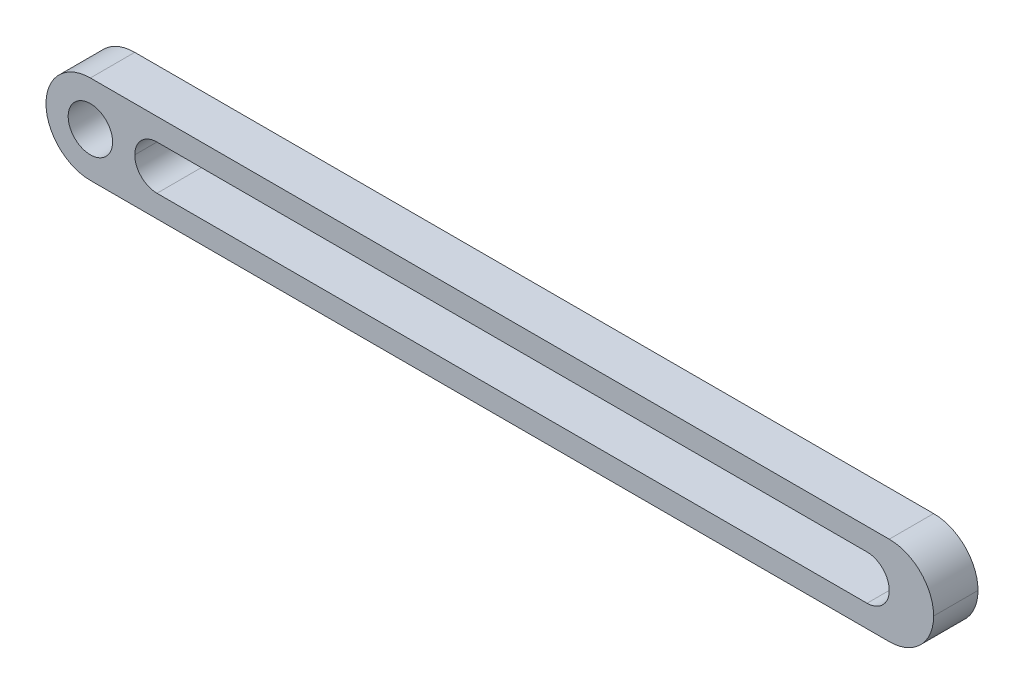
ISO-10303-21;
HEADER;
FILE_DESCRIPTION(('STEP AP214'),'2;1');
FILE_NAME('part.step','',(''),(''),'','','');
FILE_SCHEMA(('AUTOMOTIVE_DESIGN { 1 0 10303 214 1 1 1 1 }'));
ENDSEC;
DATA;
#1=APPLICATION_CONTEXT('core data for automotive mechanical design processes');
#2=APPLICATION_PROTOCOL_DEFINITION('international standard','automotive_design',2000,#1);
#3=PRODUCT_CONTEXT('',#1,'mechanical');
#4=PRODUCT('Part','Part','',(#3));
#5=PRODUCT_RELATED_PRODUCT_CATEGORY('part','',(#4));
#6=PRODUCT_DEFINITION_FORMATION('','',#4);
#7=PRODUCT_DEFINITION_CONTEXT('part definition',#1,'design');
#8=PRODUCT_DEFINITION('design','',#6,#7);
#9=PRODUCT_DEFINITION_SHAPE('','',#8);
#10=(LENGTH_UNIT() NAMED_UNIT(*) SI_UNIT(.MILLI.,.METRE.));
#11=(NAMED_UNIT(*) PLANE_ANGLE_UNIT() SI_UNIT($,.RADIAN.));
#12=(NAMED_UNIT(*) SI_UNIT($,.STERADIAN.) SOLID_ANGLE_UNIT());
#13=UNCERTAINTY_MEASURE_WITH_UNIT(LENGTH_MEASURE(1.E-05),#10,'distance_accuracy_value','');
#14=(GEOMETRIC_REPRESENTATION_CONTEXT(3) GLOBAL_UNCERTAINTY_ASSIGNED_CONTEXT((#13)) GLOBAL_UNIT_ASSIGNED_CONTEXT((#10,
#11,#12)) REPRESENTATION_CONTEXT('',''));
#15=CARTESIAN_POINT('',(0.,0.,0.));
#16=DIRECTION('',(0.,0.,1.));
#17=DIRECTION('',(1.,0.,0.));
#18=AXIS2_PLACEMENT_3D('',#15,#16,#17);
#19=CARTESIAN_POINT('',(0.,0.,10.));
#20=DIRECTION('',(0.,1.,0.));
#21=DIRECTION('',(0.,0.,1.));
#22=AXIS2_PLACEMENT_3D('',#19,#20,#21);
#23=PLANE('',#22);
#24=DIRECTION('',(1.,0.,0.));
#25=VECTOR('',#24,1.);
#26=CARTESIAN_POINT('',(0.,0.,0.));
#27=LINE('',#26,#25);
#28=CARTESIAN_POINT('',(10.,0.,0.));
#29=VERTEX_POINT('',#28);
#30=CARTESIAN_POINT('',(190.,0.,0.));
#31=VERTEX_POINT('',#30);
#32=EDGE_CURVE('E129',#29,#31,#27,.T.);
#33=ORIENTED_EDGE('',*,*,#32,.T.);
#34=DIRECTION('',(0.,0.,-1.));
#35=VECTOR('',#34,1.);
#36=CARTESIAN_POINT('',(190.,0.,10.));
#37=LINE('',#36,#35);
#38=CARTESIAN_POINT('',(190.,0.,10.));
#39=VERTEX_POINT('',#38);
#40=EDGE_CURVE('E226',#31,#39,#37,.F.);
#41=ORIENTED_EDGE('',*,*,#40,.T.);
#42=DIRECTION('',(1.,0.,0.));
#43=VECTOR('',#42,1.);
#44=CARTESIAN_POINT('',(0.,0.,10.));
#45=LINE('',#44,#43);
#46=CARTESIAN_POINT('',(10.,0.,10.));
#47=VERTEX_POINT('',#46);
#48=EDGE_CURVE('E213',#47,#39,#45,.T.);
#49=ORIENTED_EDGE('',*,*,#48,.F.);
#50=DIRECTION('',(0.,0.,-1.));
#51=VECTOR('',#50,1.);
#52=CARTESIAN_POINT('',(10.,0.,10.));
#53=LINE('',#52,#51);
#54=EDGE_CURVE('E224',#47,#29,#53,.T.);
#55=ORIENTED_EDGE('',*,*,#54,.T.);
#56=EDGE_LOOP('',(#33,#41,#49,#55));
#57=FACE_BOUND('',#56,.T.);
#58=ADVANCED_FACE('F33',(#57),#23,.F.);
#59=CARTESIAN_POINT('',(0.,20.,10.));
#60=DIRECTION('',(0.,-1.,0.));
#61=DIRECTION('',(0.,0.,-1.));
#62=AXIS2_PLACEMENT_3D('',#59,#60,#61);
#63=PLANE('',#62);
#64=DIRECTION('',(-1.,0.,0.));
#65=VECTOR('',#64,1.);
#66=CARTESIAN_POINT('',(0.,20.,10.));
#67=LINE('',#66,#65);
#68=CARTESIAN_POINT('',(190.,20.,10.));
#69=VERTEX_POINT('',#68);
#70=CARTESIAN_POINT('',(10.,20.,10.));
#71=VERTEX_POINT('',#70);
#72=EDGE_CURVE('E144',#69,#71,#67,.T.);
#73=ORIENTED_EDGE('',*,*,#72,.F.);
#74=DIRECTION('',(0.,0.,-1.));
#75=VECTOR('',#74,1.);
#76=CARTESIAN_POINT('',(190.,20.,10.));
#77=LINE('',#76,#75);
#78=CARTESIAN_POINT('',(190.,20.,0.));
#79=VERTEX_POINT('',#78);
#80=EDGE_CURVE('E161',#69,#79,#77,.T.);
#81=ORIENTED_EDGE('',*,*,#80,.T.);
#82=DIRECTION('',(-1.,0.,0.));
#83=VECTOR('',#82,1.);
#84=CARTESIAN_POINT('',(0.,20.,0.));
#85=LINE('',#84,#83);
#86=CARTESIAN_POINT('',(10.,20.,0.));
#87=VERTEX_POINT('',#86);
#88=EDGE_CURVE('E216',#79,#87,#85,.T.);
#89=ORIENTED_EDGE('',*,*,#88,.T.);
#90=DIRECTION('',(0.,0.,-1.));
#91=VECTOR('',#90,1.);
#92=CARTESIAN_POINT('',(10.,20.,10.));
#93=LINE('',#92,#91);
#94=EDGE_CURVE('E143',#87,#71,#93,.F.);
#95=ORIENTED_EDGE('',*,*,#94,.T.);
#96=EDGE_LOOP('',(#73,#81,#89,#95));
#97=FACE_BOUND('',#96,.T.);
#98=ADVANCED_FACE('F239',(#97),#63,.F.);
#99=CARTESIAN_POINT('',(0.,0.,10.));
#100=DIRECTION('',(0.,0.,-1.));
#101=DIRECTION('',(-1.,0.,0.));
#102=AXIS2_PLACEMENT_3D('',#99,#100,#101);
#103=PLANE('',#102);
#104=CARTESIAN_POINT('',(25.,10.,10.));
#105=DIRECTION('',(0.,0.,-1.));
#106=DIRECTION('',(-1.,0.,0.));
#107=AXIS2_PLACEMENT_3D('',#104,#105,#106);
#108=CIRCLE('',#107,5.);
#109=CARTESIAN_POINT('',(25.,5.,10.));
#110=VERTEX_POINT('',#109);
#111=CARTESIAN_POINT('',(20.,10.,10.));
#112=VERTEX_POINT('',#111);
#113=EDGE_CURVE('E56',#110,#112,#108,.T.);
#114=ORIENTED_EDGE('',*,*,#113,.T.);
#115=CARTESIAN_POINT('',(25.,10.,10.));
#116=DIRECTION('',(0.,0.,-1.));
#117=DIRECTION('',(-1.,0.,0.));
#118=AXIS2_PLACEMENT_3D('',#115,#116,#117);
#119=CIRCLE('',#118,5.);
#120=CARTESIAN_POINT('',(25.,15.,10.));
#121=VERTEX_POINT('',#120);
#122=EDGE_CURVE('E42',#112,#121,#119,.T.);
#123=ORIENTED_EDGE('',*,*,#122,.T.);
#124=DIRECTION('',(-1.,0.,0.));
#125=VECTOR('',#124,1.);
#126=CARTESIAN_POINT('',(20.,15.,10.));
#127=LINE('',#126,#125);
#128=CARTESIAN_POINT('',(185.,15.,10.));
#129=VERTEX_POINT('',#128);
#130=EDGE_CURVE('E187',#129,#121,#127,.T.);
#131=ORIENTED_EDGE('',*,*,#130,.F.);
#132=CARTESIAN_POINT('',(185.,10.,10.));
#133=DIRECTION('',(0.,0.,-1.));
#134=DIRECTION('',(-1.,0.,0.));
#135=AXIS2_PLACEMENT_3D('',#132,#133,#134);
#136=CIRCLE('',#135,5.);
#137=CARTESIAN_POINT('',(190.,10.,10.));
#138=VERTEX_POINT('',#137);
#139=EDGE_CURVE('E169',#129,#138,#136,.T.);
#140=ORIENTED_EDGE('',*,*,#139,.T.);
#141=CARTESIAN_POINT('',(185.,10.,10.));
#142=DIRECTION('',(0.,0.,-1.));
#143=DIRECTION('',(-1.,0.,0.));
#144=AXIS2_PLACEMENT_3D('',#141,#142,#143);
#145=CIRCLE('',#144,5.);
#146=CARTESIAN_POINT('',(185.,5.,10.));
#147=VERTEX_POINT('',#146);
#148=EDGE_CURVE('E173',#138,#147,#145,.T.);
#149=ORIENTED_EDGE('',*,*,#148,.T.);
#150=DIRECTION('',(1.,0.,0.));
#151=VECTOR('',#150,1.);
#152=CARTESIAN_POINT('',(20.,5.,10.));
#153=LINE('',#152,#151);
#154=EDGE_CURVE('E182',#110,#147,#153,.T.);
#155=ORIENTED_EDGE('',*,*,#154,.F.);
#156=EDGE_LOOP('',(#114,#123,#131,#140,#149,#155));
#157=FACE_BOUND('',#156,.T.);
#158=CARTESIAN_POINT('',(10.,10.,10.));
#159=DIRECTION('',(0.,0.,1.));
#160=DIRECTION('',(1.,0.,0.));
#161=AXIS2_PLACEMENT_3D('',#158,#159,#160);
#162=CIRCLE('',#161,5.);
#163=CARTESIAN_POINT('',(15.,10.,10.));
#164=VERTEX_POINT('',#163);
#165=EDGE_CURVE('E154',#164,#164,#162,.T.);
#166=ORIENTED_EDGE('',*,*,#165,.F.);
#167=EDGE_LOOP('',(#166));
#168=FACE_BOUND('',#167,.T.);
#169=ORIENTED_EDGE('',*,*,#48,.T.);
#170=CARTESIAN_POINT('',(190.,10.,10.));
#171=DIRECTION('',(0.,0.,-1.));
#172=DIRECTION('',(-1.,0.,0.));
#173=AXIS2_PLACEMENT_3D('',#170,#171,#172);
#174=CIRCLE('',#173,10.);
#175=CARTESIAN_POINT('',(200.,10.,10.));
#176=VERTEX_POINT('',#175);
#177=EDGE_CURVE('E234',#39,#176,#174,.F.);
#178=ORIENTED_EDGE('',*,*,#177,.T.);
#179=CARTESIAN_POINT('',(190.,10.,10.));
#180=DIRECTION('',(0.,0.,-1.));
#181=DIRECTION('',(-1.,0.,0.));
#182=AXIS2_PLACEMENT_3D('',#179,#180,#181);
#183=CIRCLE('',#182,10.);
#184=EDGE_CURVE('E232',#176,#69,#183,.F.);
#185=ORIENTED_EDGE('',*,*,#184,.T.);
#186=ORIENTED_EDGE('',*,*,#72,.T.);
#187=CARTESIAN_POINT('',(10.,10.,10.));
#188=DIRECTION('',(0.,0.,-1.));
#189=DIRECTION('',(-1.,0.,0.));
#190=AXIS2_PLACEMENT_3D('',#187,#188,#189);
#191=CIRCLE('',#190,10.);
#192=CARTESIAN_POINT('',(0.,10.,10.));
#193=VERTEX_POINT('',#192);
#194=EDGE_CURVE('E229',#71,#193,#191,.F.);
#195=ORIENTED_EDGE('',*,*,#194,.T.);
#196=CARTESIAN_POINT('',(10.,10.,10.));
#197=DIRECTION('',(0.,0.,-1.));
#198=DIRECTION('',(-1.,0.,0.));
#199=AXIS2_PLACEMENT_3D('',#196,#197,#198);
#200=CIRCLE('',#199,10.);
#201=EDGE_CURVE('E147',#193,#47,#200,.F.);
#202=ORIENTED_EDGE('',*,*,#201,.T.);
#203=EDGE_LOOP('',(#169,#178,#185,#186,#195,#202));
#204=FACE_BOUND('',#203,.T.);
#205=ADVANCED_FACE('F198',(#157,#168,#204),#103,.F.);
#206=CARTESIAN_POINT('',(0.,0.,0.));
#207=DIRECTION('',(0.,0.,-1.));
#208=DIRECTION('',(-1.,0.,0.));
#209=AXIS2_PLACEMENT_3D('',#206,#207,#208);
#210=PLANE('',#209);
#211=DIRECTION('',(-1.,0.,0.));
#212=VECTOR('',#211,1.);
#213=CARTESIAN_POINT('',(20.,15.,0.));
#214=LINE('',#213,#212);
#215=CARTESIAN_POINT('',(185.,15.,0.));
#216=VERTEX_POINT('',#215);
#217=CARTESIAN_POINT('',(25.,15.,0.));
#218=VERTEX_POINT('',#217);
#219=EDGE_CURVE('E207',#216,#218,#214,.T.);
#220=ORIENTED_EDGE('',*,*,#219,.T.);
#221=CARTESIAN_POINT('',(25.,10.,0.));
#222=DIRECTION('',(0.,0.,-1.));
#223=DIRECTION('',(-1.,0.,0.));
#224=AXIS2_PLACEMENT_3D('',#221,#222,#223);
#225=CIRCLE('',#224,5.);
#226=CARTESIAN_POINT('',(20.,10.,0.));
#227=VERTEX_POINT('',#226);
#228=EDGE_CURVE('E11',#218,#227,#225,.F.);
#229=ORIENTED_EDGE('',*,*,#228,.T.);
#230=CARTESIAN_POINT('',(25.,10.,0.));
#231=DIRECTION('',(0.,0.,-1.));
#232=DIRECTION('',(-1.,0.,0.));
#233=AXIS2_PLACEMENT_3D('',#230,#231,#232);
#234=CIRCLE('',#233,5.);
#235=CARTESIAN_POINT('',(25.,5.,0.));
#236=VERTEX_POINT('',#235);
#237=EDGE_CURVE('E178',#227,#236,#234,.F.);
#238=ORIENTED_EDGE('',*,*,#237,.T.);
#239=DIRECTION('',(1.,0.,0.));
#240=VECTOR('',#239,1.);
#241=CARTESIAN_POINT('',(20.,5.,0.));
#242=LINE('',#241,#240);
#243=CARTESIAN_POINT('',(185.,5.,0.));
#244=VERTEX_POINT('',#243);
#245=EDGE_CURVE('E204',#236,#244,#242,.T.);
#246=ORIENTED_EDGE('',*,*,#245,.T.);
#247=CARTESIAN_POINT('',(185.,10.,0.));
#248=DIRECTION('',(0.,0.,-1.));
#249=DIRECTION('',(-1.,0.,0.));
#250=AXIS2_PLACEMENT_3D('',#247,#248,#249);
#251=CIRCLE('',#250,5.);
#252=CARTESIAN_POINT('',(190.,10.,0.));
#253=VERTEX_POINT('',#252);
#254=EDGE_CURVE('E175',#244,#253,#251,.F.);
#255=ORIENTED_EDGE('',*,*,#254,.T.);
#256=CARTESIAN_POINT('',(185.,10.,0.));
#257=DIRECTION('',(0.,0.,-1.));
#258=DIRECTION('',(-1.,0.,0.));
#259=AXIS2_PLACEMENT_3D('',#256,#257,#258);
#260=CIRCLE('',#259,5.);
#261=EDGE_CURVE('E171',#253,#216,#260,.F.);
#262=ORIENTED_EDGE('',*,*,#261,.T.);
#263=EDGE_LOOP('',(#220,#229,#238,#246,#255,#262));
#264=FACE_BOUND('',#263,.T.);
#265=CARTESIAN_POINT('',(10.,10.,0.));
#266=DIRECTION('',(0.,0.,1.));
#267=DIRECTION('',(1.,0.,0.));
#268=AXIS2_PLACEMENT_3D('',#265,#266,#267);
#269=CIRCLE('',#268,5.);
#270=CARTESIAN_POINT('',(15.,10.,0.));
#271=VERTEX_POINT('',#270);
#272=EDGE_CURVE('E149',#271,#271,#269,.T.);
#273=ORIENTED_EDGE('',*,*,#272,.T.);
#274=EDGE_LOOP('',(#273));
#275=FACE_BOUND('',#274,.T.);
#276=CARTESIAN_POINT('',(190.,10.,0.));
#277=DIRECTION('',(0.,0.,-1.));
#278=DIRECTION('',(-1.,0.,0.));
#279=AXIS2_PLACEMENT_3D('',#276,#277,#278);
#280=CIRCLE('',#279,10.);
#281=CARTESIAN_POINT('',(200.,10.,0.));
#282=VERTEX_POINT('',#281);
#283=EDGE_CURVE('E134',#79,#282,#280,.T.);
#284=ORIENTED_EDGE('',*,*,#283,.T.);
#285=CARTESIAN_POINT('',(190.,10.,0.));
#286=DIRECTION('',(0.,0.,-1.));
#287=DIRECTION('',(-1.,0.,0.));
#288=AXIS2_PLACEMENT_3D('',#285,#286,#287);
#289=CIRCLE('',#288,10.);
#290=EDGE_CURVE('E222',#282,#31,#289,.T.);
#291=ORIENTED_EDGE('',*,*,#290,.T.);
#292=ORIENTED_EDGE('',*,*,#32,.F.);
#293=CARTESIAN_POINT('',(10.,10.,0.));
#294=DIRECTION('',(0.,0.,-1.));
#295=DIRECTION('',(-1.,0.,0.));
#296=AXIS2_PLACEMENT_3D('',#293,#294,#295);
#297=CIRCLE('',#296,10.);
#298=CARTESIAN_POINT('',(0.,10.,0.));
#299=VERTEX_POINT('',#298);
#300=EDGE_CURVE('E122',#29,#299,#297,.T.);
#301=ORIENTED_EDGE('',*,*,#300,.T.);
#302=CARTESIAN_POINT('',(10.,10.,0.));
#303=DIRECTION('',(0.,0.,-1.));
#304=DIRECTION('',(-1.,0.,0.));
#305=AXIS2_PLACEMENT_3D('',#302,#303,#304);
#306=CIRCLE('',#305,10.);
#307=EDGE_CURVE('E126',#299,#87,#306,.T.);
#308=ORIENTED_EDGE('',*,*,#307,.T.);
#309=ORIENTED_EDGE('',*,*,#88,.F.);
#310=EDGE_LOOP('',(#284,#291,#292,#301,#308,#309));
#311=FACE_BOUND('',#310,.T.);
#312=ADVANCED_FACE('F124',(#264,#275,#311),#210,.T.);
#313=CARTESIAN_POINT('',(190.,10.,10.));
#314=DIRECTION('',(0.,0.,-1.));
#315=DIRECTION('',(-1.,0.,0.));
#316=AXIS2_PLACEMENT_3D('',#313,#314,#315);
#317=CYLINDRICAL_SURFACE('',#316,10.);
#318=ORIENTED_EDGE('',*,*,#80,.F.);
#319=ORIENTED_EDGE('',*,*,#184,.F.);
#320=DIRECTION('',(0.,0.,-1.));
#321=VECTOR('',#320,1.);
#322=CARTESIAN_POINT('',(200.,10.,10.));
#323=LINE('',#322,#321);
#324=EDGE_CURVE('E148',#282,#176,#323,.F.);
#325=ORIENTED_EDGE('',*,*,#324,.F.);
#326=ORIENTED_EDGE('',*,*,#283,.F.);
#327=EDGE_LOOP('',(#318,#319,#325,#326));
#328=FACE_BOUND('',#327,.T.);
#329=ADVANCED_FACE('F244',(#328),#317,.T.);
#330=CARTESIAN_POINT('',(190.,10.,10.));
#331=DIRECTION('',(0.,0.,-1.));
#332=DIRECTION('',(-1.,0.,0.));
#333=AXIS2_PLACEMENT_3D('',#330,#331,#332);
#334=CYLINDRICAL_SURFACE('',#333,10.);
#335=ORIENTED_EDGE('',*,*,#177,.F.);
#336=ORIENTED_EDGE('',*,*,#40,.F.);
#337=ORIENTED_EDGE('',*,*,#290,.F.);
#338=ORIENTED_EDGE('',*,*,#324,.T.);
#339=EDGE_LOOP('',(#335,#336,#337,#338));
#340=FACE_BOUND('',#339,.T.);
#341=ADVANCED_FACE('F248',(#340),#334,.T.);
#342=CARTESIAN_POINT('',(10.,10.,10.));
#343=DIRECTION('',(0.,0.,-1.));
#344=DIRECTION('',(-1.,0.,0.));
#345=AXIS2_PLACEMENT_3D('',#342,#343,#344);
#346=CYLINDRICAL_SURFACE('',#345,10.);
#347=DIRECTION('',(0.,0.,-1.));
#348=VECTOR('',#347,1.);
#349=CARTESIAN_POINT('',(0.,10.,10.));
#350=LINE('',#349,#348);
#351=EDGE_CURVE('E141',#193,#299,#350,.T.);
#352=ORIENTED_EDGE('',*,*,#351,.F.);
#353=ORIENTED_EDGE('',*,*,#194,.F.);
#354=ORIENTED_EDGE('',*,*,#94,.F.);
#355=ORIENTED_EDGE('',*,*,#307,.F.);
#356=EDGE_LOOP('',(#352,#353,#354,#355));
#357=FACE_BOUND('',#356,.T.);
#358=ADVANCED_FACE('F139',(#357),#346,.T.);
#359=CARTESIAN_POINT('',(10.,10.,10.));
#360=DIRECTION('',(0.,0.,-1.));
#361=DIRECTION('',(-1.,0.,0.));
#362=AXIS2_PLACEMENT_3D('',#359,#360,#361);
#363=CYLINDRICAL_SURFACE('',#362,10.);
#364=ORIENTED_EDGE('',*,*,#201,.F.);
#365=ORIENTED_EDGE('',*,*,#351,.T.);
#366=ORIENTED_EDGE('',*,*,#300,.F.);
#367=ORIENTED_EDGE('',*,*,#54,.F.);
#368=EDGE_LOOP('',(#364,#365,#366,#367));
#369=FACE_BOUND('',#368,.T.);
#370=ADVANCED_FACE('F146',(#369),#363,.T.);
#371=CARTESIAN_POINT('',(10.,10.,0.));
#372=DIRECTION('',(0.,0.,1.));
#373=DIRECTION('',(1.,0.,0.));
#374=AXIS2_PLACEMENT_3D('',#371,#372,#373);
#375=CYLINDRICAL_SURFACE('',#374,5.);
#376=ORIENTED_EDGE('',*,*,#272,.F.);
#377=EDGE_LOOP('',(#376));
#378=FACE_BOUND('',#377,.T.);
#379=ORIENTED_EDGE('',*,*,#165,.T.);
#380=EDGE_LOOP('',(#379));
#381=FACE_BOUND('',#380,.T.);
#382=ADVANCED_FACE('F272',(#378,#381),#375,.F.);
#383=CARTESIAN_POINT('',(20.,15.,0.));
#384=DIRECTION('',(0.,1.,0.));
#385=DIRECTION('',(0.,0.,1.));
#386=AXIS2_PLACEMENT_3D('',#383,#384,#385);
#387=PLANE('',#386);
#388=ORIENTED_EDGE('',*,*,#219,.F.);
#389=DIRECTION('',(0.,0.,1.));
#390=VECTOR('',#389,1.);
#391=CARTESIAN_POINT('',(185.,15.,10.));
#392=LINE('',#391,#390);
#393=EDGE_CURVE('E160',#216,#129,#392,.T.);
#394=ORIENTED_EDGE('',*,*,#393,.T.);
#395=ORIENTED_EDGE('',*,*,#130,.T.);
#396=DIRECTION('',(0.,0.,1.));
#397=VECTOR('',#396,1.);
#398=CARTESIAN_POINT('',(25.,15.,0.));
#399=LINE('',#398,#397);
#400=EDGE_CURVE('E158',#121,#218,#399,.F.);
#401=ORIENTED_EDGE('',*,*,#400,.T.);
#402=EDGE_LOOP('',(#388,#394,#395,#401));
#403=FACE_BOUND('',#402,.T.);
#404=ADVANCED_FACE('F202',(#403),#387,.F.);
#405=CARTESIAN_POINT('',(20.,5.,0.));
#406=DIRECTION('',(0.,-1.,0.));
#407=DIRECTION('',(0.,0.,-1.));
#408=AXIS2_PLACEMENT_3D('',#405,#406,#407);
#409=PLANE('',#408);
#410=ORIENTED_EDGE('',*,*,#154,.T.);
#411=DIRECTION('',(0.,0.,1.));
#412=VECTOR('',#411,1.);
#413=CARTESIAN_POINT('',(185.,5.,0.));
#414=LINE('',#413,#412);
#415=EDGE_CURVE('E167',#147,#244,#414,.F.);
#416=ORIENTED_EDGE('',*,*,#415,.T.);
#417=ORIENTED_EDGE('',*,*,#245,.F.);
#418=DIRECTION('',(0.,0.,1.));
#419=VECTOR('',#418,1.);
#420=CARTESIAN_POINT('',(25.,5.,10.));
#421=LINE('',#420,#419);
#422=EDGE_CURVE('E164',#236,#110,#421,.T.);
#423=ORIENTED_EDGE('',*,*,#422,.T.);
#424=EDGE_LOOP('',(#410,#416,#417,#423));
#425=FACE_BOUND('',#424,.T.);
#426=ADVANCED_FACE('F280',(#425),#409,.F.);
#427=CARTESIAN_POINT('',(185.,10.,0.));
#428=DIRECTION('',(0.,0.,-1.));
#429=DIRECTION('',(-1.,0.,0.));
#430=AXIS2_PLACEMENT_3D('',#427,#428,#429);
#431=CYLINDRICAL_SURFACE('',#430,5.);
#432=DIRECTION('',(0.,0.,1.));
#433=VECTOR('',#432,1.);
#434=CARTESIAN_POINT('',(190.,10.,10.));
#435=LINE('',#434,#433);
#436=EDGE_CURVE('E180',#253,#138,#435,.T.);
#437=ORIENTED_EDGE('',*,*,#436,.F.);
#438=ORIENTED_EDGE('',*,*,#254,.F.);
#439=ORIENTED_EDGE('',*,*,#415,.F.);
#440=ORIENTED_EDGE('',*,*,#148,.F.);
#441=EDGE_LOOP('',(#437,#438,#439,#440));
#442=FACE_BOUND('',#441,.T.);
#443=ADVANCED_FACE('F278',(#442),#431,.F.);
#444=CARTESIAN_POINT('',(185.,10.,0.));
#445=DIRECTION('',(0.,0.,-1.));
#446=DIRECTION('',(-1.,0.,0.));
#447=AXIS2_PLACEMENT_3D('',#444,#445,#446);
#448=CYLINDRICAL_SURFACE('',#447,5.);
#449=ORIENTED_EDGE('',*,*,#261,.F.);
#450=ORIENTED_EDGE('',*,*,#436,.T.);
#451=ORIENTED_EDGE('',*,*,#139,.F.);
#452=ORIENTED_EDGE('',*,*,#393,.F.);
#453=EDGE_LOOP('',(#449,#450,#451,#452));
#454=FACE_BOUND('',#453,.T.);
#455=ADVANCED_FACE('F275',(#454),#448,.F.);
#456=CARTESIAN_POINT('',(25.,10.,0.));
#457=DIRECTION('',(0.,0.,-1.));
#458=DIRECTION('',(-1.,0.,0.));
#459=AXIS2_PLACEMENT_3D('',#456,#457,#458);
#460=CYLINDRICAL_SURFACE('',#459,5.);
#461=DIRECTION('',(0.,0.,1.));
#462=VECTOR('',#461,1.);
#463=CARTESIAN_POINT('',(20.,10.,10.));
#464=LINE('',#463,#462);
#465=EDGE_CURVE('E37',#227,#112,#464,.T.);
#466=ORIENTED_EDGE('',*,*,#465,.F.);
#467=ORIENTED_EDGE('',*,*,#228,.F.);
#468=ORIENTED_EDGE('',*,*,#400,.F.);
#469=ORIENTED_EDGE('',*,*,#122,.F.);
#470=EDGE_LOOP('',(#466,#467,#468,#469));
#471=FACE_BOUND('',#470,.T.);
#472=ADVANCED_FACE('F35',(#471),#460,.F.);
#473=CARTESIAN_POINT('',(25.,10.,0.));
#474=DIRECTION('',(0.,0.,-1.));
#475=DIRECTION('',(-1.,0.,0.));
#476=AXIS2_PLACEMENT_3D('',#473,#474,#475);
#477=CYLINDRICAL_SURFACE('',#476,5.);
#478=ORIENTED_EDGE('',*,*,#237,.F.);
#479=ORIENTED_EDGE('',*,*,#465,.T.);
#480=ORIENTED_EDGE('',*,*,#113,.F.);
#481=ORIENTED_EDGE('',*,*,#422,.F.);
#482=EDGE_LOOP('',(#478,#479,#480,#481));
#483=FACE_BOUND('',#482,.T.);
#484=ADVANCED_FACE('F192',(#483),#477,.F.);
#485=CLOSED_SHELL('',(#58,#98,#205,#312,#329,#341,#358,#370,#382,#404,#426,#443,#455,#472,#484));
#486=MANIFOLD_SOLID_BREP('B2',#485);
#487=ADVANCED_BREP_SHAPE_REPRESENTATION('',(#18,#486),#14);
#488=SHAPE_DEFINITION_REPRESENTATION(#9,#487);
ENDSEC;
END-ISO-10303-21;
